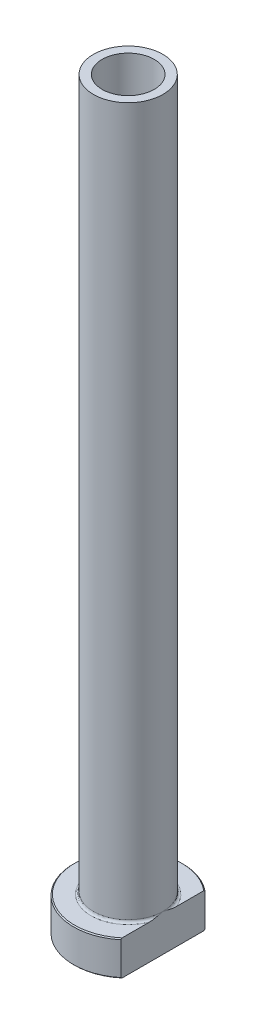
ISO-10303-21;
HEADER;
FILE_DESCRIPTION(('STEP AP214'),'2;1');
FILE_NAME('part.step','',(''),(''),'','','');
FILE_SCHEMA(('AUTOMOTIVE_DESIGN { 1 0 10303 214 1 1 1 1 }'));
ENDSEC;
DATA;
#1=APPLICATION_CONTEXT('core data for automotive mechanical design processes');
#2=APPLICATION_PROTOCOL_DEFINITION('international standard','automotive_design',2000,#1);
#3=PRODUCT_CONTEXT('',#1,'mechanical');
#4=PRODUCT('Part','Part','',(#3));
#5=PRODUCT_RELATED_PRODUCT_CATEGORY('part','',(#4));
#6=PRODUCT_DEFINITION_FORMATION('','',#4);
#7=PRODUCT_DEFINITION_CONTEXT('part definition',#1,'design');
#8=PRODUCT_DEFINITION('design','',#6,#7);
#9=PRODUCT_DEFINITION_SHAPE('','',#8);
#10=(LENGTH_UNIT() NAMED_UNIT(*) SI_UNIT(.MILLI.,.METRE.));
#11=(NAMED_UNIT(*) PLANE_ANGLE_UNIT() SI_UNIT($,.RADIAN.));
#12=(NAMED_UNIT(*) SI_UNIT($,.STERADIAN.) SOLID_ANGLE_UNIT());
#13=UNCERTAINTY_MEASURE_WITH_UNIT(LENGTH_MEASURE(1.E-05),#10,'distance_accuracy_value','');
#14=(GEOMETRIC_REPRESENTATION_CONTEXT(3) GLOBAL_UNCERTAINTY_ASSIGNED_CONTEXT((#13)) GLOBAL_UNIT_ASSIGNED_CONTEXT((#10,
#11,#12)) REPRESENTATION_CONTEXT('',''));
#15=CARTESIAN_POINT('',(0.,0.,0.));
#16=DIRECTION('',(0.,0.,1.));
#17=DIRECTION('',(1.,0.,0.));
#18=AXIS2_PLACEMENT_3D('',#15,#16,#17);
#19=CARTESIAN_POINT('',(0.,92.1876809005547,0.));
#20=DIRECTION('',(0.,1.,0.));
#21=DIRECTION('',(0.,0.,1.));
#22=AXIS2_PLACEMENT_3D('',#19,#20,#21);
#23=CYLINDRICAL_SURFACE('',#22,5.25);
#24=CARTESIAN_POINT('',(0.,150.,0.));
#25=DIRECTION('',(0.,1.,0.));
#26=DIRECTION('',(0.,0.,1.));
#27=AXIS2_PLACEMENT_3D('',#24,#25,#26);
#28=CIRCLE('',#27,5.25);
#29=CARTESIAN_POINT('',(0.,150.,5.25));
#30=VERTEX_POINT('',#29);
#31=EDGE_CURVE('E167',#30,#30,#28,.T.);
#32=ORIENTED_EDGE('',*,*,#31,.T.);
#33=EDGE_LOOP('',(#32));
#34=FACE_BOUND('',#33,.T.);
#35=CARTESIAN_POINT('',(0.,95.,0.));
#36=DIRECTION('',(0.,1.,0.));
#37=DIRECTION('',(0.,0.,1.));
#38=AXIS2_PLACEMENT_3D('',#35,#36,#37);
#39=CIRCLE('',#38,5.25);
#40=CARTESIAN_POINT('',(0.,95.,5.25));
#41=VERTEX_POINT('',#40);
#42=EDGE_CURVE('E170',#41,#41,#39,.T.);
#43=ORIENTED_EDGE('',*,*,#42,.F.);
#44=EDGE_LOOP('',(#43));
#45=FACE_BOUND('',#44,.T.);
#46=ADVANCED_FACE('F32',(#34,#45),#23,.F.);
#47=CARTESIAN_POINT('',(-5.25,150.,0.));
#48=DIRECTION('',(0.,1.,0.));
#49=DIRECTION('',(0.,0.,1.));
#50=AXIS2_PLACEMENT_3D('',#47,#48,#49);
#51=PLANE('',#50);
#52=CARTESIAN_POINT('',(0.,150.,0.));
#53=DIRECTION('',(0.,1.,0.));
#54=DIRECTION('',(0.,0.,1.));
#55=AXIS2_PLACEMENT_3D('',#52,#53,#54);
#56=CIRCLE('',#55,7.00000000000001);
#57=CARTESIAN_POINT('',(0.,150.,7.00000000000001));
#58=VERTEX_POINT('',#57);
#59=EDGE_CURVE('E174',#58,#58,#56,.T.);
#60=ORIENTED_EDGE('',*,*,#59,.T.);
#61=EDGE_LOOP('',(#60));
#62=FACE_BOUND('',#61,.T.);
#63=ORIENTED_EDGE('',*,*,#31,.F.);
#64=EDGE_LOOP('',(#63));
#65=FACE_BOUND('',#64,.T.);
#66=ADVANCED_FACE('F157',(#62,#65),#51,.T.);
#67=CARTESIAN_POINT('',(0.,92.1876809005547,0.));
#68=DIRECTION('',(0.,1.,0.));
#69=DIRECTION('',(0.,0.,1.));
#70=AXIS2_PLACEMENT_3D('',#67,#68,#69);
#71=CYLINDRICAL_SURFACE('',#70,7.);
#72=CARTESIAN_POINT('',(0.,7.50000000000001,0.));
#73=DIRECTION('',(0.,1.,0.));
#74=DIRECTION('',(0.,0.,1.));
#75=AXIS2_PLACEMENT_3D('',#72,#73,#74);
#76=CIRCLE('',#75,7.);
#77=CARTESIAN_POINT('',(7.,7.50000000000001,0.));
#78=VERTEX_POINT('',#77);
#79=EDGE_CURVE('E180',#78,#78,#76,.T.);
#80=ORIENTED_EDGE('',*,*,#79,.T.);
#81=EDGE_LOOP('',(#80));
#82=FACE_BOUND('',#81,.T.);
#83=ORIENTED_EDGE('',*,*,#59,.F.);
#84=EDGE_LOOP('',(#83));
#85=FACE_BOUND('',#84,.T.);
#86=ADVANCED_FACE('F162',(#82,#85),#71,.T.);
#87=CARTESIAN_POINT('',(-6.99999999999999,7.,0.));
#88=DIRECTION('',(0.,1.,0.));
#89=DIRECTION('',(0.,0.,1.));
#90=AXIS2_PLACEMENT_3D('',#87,#88,#89);
#91=PLANE('',#90);
#92=DIRECTION('',(0.,0.,1.));
#93=VECTOR('',#92,1.);
#94=CARTESIAN_POINT('',(6.99999999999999,7.,0.));
#95=LINE('',#94,#93);
#96=CARTESIAN_POINT('',(7.,7.,-8.22435407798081));
#97=VERTEX_POINT('',#96);
#98=CARTESIAN_POINT('',(6.99999999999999,7.,-2.69258240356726));
#99=VERTEX_POINT('',#98);
#100=EDGE_CURVE('E54',#97,#99,#95,.T.);
#101=ORIENTED_EDGE('',*,*,#100,.F.);
#102=CARTESIAN_POINT('',(0.,7.,0.));
#103=DIRECTION('',(0.,1.,0.));
#104=DIRECTION('',(0.,0.,1.));
#105=AXIS2_PLACEMENT_3D('',#102,#103,#104);
#106=CIRCLE('',#105,10.8);
#107=CARTESIAN_POINT('',(6.99999999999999,7.,8.22435407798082));
#108=VERTEX_POINT('',#107);
#109=EDGE_CURVE('E186',#97,#108,#106,.T.);
#110=ORIENTED_EDGE('',*,*,#109,.T.);
#111=CARTESIAN_POINT('',(6.99999999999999,7.,2.69258240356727));
#112=VERTEX_POINT('',#111);
#113=EDGE_CURVE('E134',#112,#108,#95,.T.);
#114=ORIENTED_EDGE('',*,*,#113,.F.);
#115=CARTESIAN_POINT('',(0.,7.,0.));
#116=DIRECTION('',(0.,1.,0.));
#117=DIRECTION('',(0.,0.,1.));
#118=AXIS2_PLACEMENT_3D('',#115,#116,#117);
#119=CIRCLE('',#118,7.5);
#120=EDGE_CURVE('E183',#112,#99,#119,.F.);
#121=ORIENTED_EDGE('',*,*,#120,.T.);
#122=EDGE_LOOP('',(#101,#110,#114,#121));
#123=FACE_BOUND('',#122,.T.);
#124=ADVANCED_FACE('F197',(#123),#91,.T.);
#125=CARTESIAN_POINT('',(0.,92.1876809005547,0.));
#126=DIRECTION('',(0.,1.,0.));
#127=DIRECTION('',(0.,0.,1.));
#128=AXIS2_PLACEMENT_3D('',#125,#126,#127);
#129=CYLINDRICAL_SURFACE('',#128,11.);
#130=DIRECTION('',(0.,-1.,0.));
#131=VECTOR('',#130,1.);
#132=CARTESIAN_POINT('',(6.99999999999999,150.,8.48528137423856));
#133=LINE('',#132,#131);
#134=CARTESIAN_POINT('',(6.99999999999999,6.79999999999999,8.48528137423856));
#135=VERTEX_POINT('',#134);
#136=CARTESIAN_POINT('',(6.99999999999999,0.200000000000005,8.48528137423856));
#137=VERTEX_POINT('',#136);
#138=EDGE_CURVE('E82',#135,#137,#133,.T.);
#139=ORIENTED_EDGE('',*,*,#138,.F.);
#140=CARTESIAN_POINT('',(0.,6.79999999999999,0.));
#141=DIRECTION('',(0.,1.,0.));
#142=DIRECTION('',(0.,0.,1.));
#143=AXIS2_PLACEMENT_3D('',#140,#141,#142);
#144=CIRCLE('',#143,11.);
#145=CARTESIAN_POINT('',(7.,6.79999999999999,-8.48528137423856));
#146=VERTEX_POINT('',#145);
#147=EDGE_CURVE('E95',#135,#146,#144,.F.);
#148=ORIENTED_EDGE('',*,*,#147,.T.);
#149=DIRECTION('',(0.,-1.,0.));
#150=VECTOR('',#149,1.);
#151=CARTESIAN_POINT('',(7.,150.,-8.48528137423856));
#152=LINE('',#151,#150);
#153=CARTESIAN_POINT('',(7.,0.200000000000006,-8.48528137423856));
#154=VERTEX_POINT('',#153);
#155=EDGE_CURVE('E192',#146,#154,#152,.T.);
#156=ORIENTED_EDGE('',*,*,#155,.T.);
#157=CARTESIAN_POINT('',(0.,0.200000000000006,0.));
#158=DIRECTION('',(0.,-1.,0.));
#159=DIRECTION('',(0.,0.,-1.));
#160=AXIS2_PLACEMENT_3D('',#157,#158,#159);
#161=CIRCLE('',#160,11.);
#162=EDGE_CURVE('E98',#154,#137,#161,.F.);
#163=ORIENTED_EDGE('',*,*,#162,.T.);
#164=EDGE_LOOP('',(#139,#148,#156,#163));
#165=FACE_BOUND('',#164,.T.);
#166=ADVANCED_FACE('F190',(#165),#129,.T.);
#167=CARTESIAN_POINT('',(-11.,0.,0.));
#168=DIRECTION('',(0.,-1.,0.));
#169=DIRECTION('',(0.,0.,-1.));
#170=AXIS2_PLACEMENT_3D('',#167,#168,#169);
#171=PLANE('',#170);
#172=CARTESIAN_POINT('',(0.,0.,0.));
#173=DIRECTION('',(0.,-1.,0.));
#174=DIRECTION('',(0.,0.,-1.));
#175=AXIS2_PLACEMENT_3D('',#172,#173,#174);
#176=CIRCLE('',#175,5.99999999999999);
#177=CARTESIAN_POINT('',(0.,0.,-5.99999999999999));
#178=VERTEX_POINT('',#177);
#179=EDGE_CURVE('E40',#178,#178,#176,.F.);
#180=ORIENTED_EDGE('',*,*,#179,.T.);
#181=EDGE_LOOP('',(#180));
#182=FACE_BOUND('',#181,.T.);
#183=DIRECTION('',(0.,0.,-1.));
#184=VECTOR('',#183,1.);
#185=CARTESIAN_POINT('',(6.99999999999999,0.,8.48528137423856));
#186=LINE('',#185,#184);
#187=CARTESIAN_POINT('',(6.99999999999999,0.,8.22435407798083));
#188=VERTEX_POINT('',#187);
#189=CARTESIAN_POINT('',(7.,0.,-8.22435407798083));
#190=VERTEX_POINT('',#189);
#191=EDGE_CURVE('E47',#188,#190,#186,.T.);
#192=ORIENTED_EDGE('',*,*,#191,.F.);
#193=CARTESIAN_POINT('',(0.,0.,0.));
#194=DIRECTION('',(0.,-1.,0.));
#195=DIRECTION('',(0.,0.,-1.));
#196=AXIS2_PLACEMENT_3D('',#193,#194,#195);
#197=CIRCLE('',#196,10.8);
#198=EDGE_CURVE('E92',#188,#190,#197,.T.);
#199=ORIENTED_EDGE('',*,*,#198,.T.);
#200=EDGE_LOOP('',(#192,#199));
#201=FACE_BOUND('',#200,.T.);
#202=ADVANCED_FACE('F91',(#182,#201),#171,.T.);
#203=CARTESIAN_POINT('',(0.,92.1876809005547,0.));
#204=DIRECTION('',(0.,1.,0.));
#205=DIRECTION('',(0.,0.,1.));
#206=AXIS2_PLACEMENT_3D('',#203,#204,#205);
#207=CYLINDRICAL_SURFACE('',#206,5.5);
#208=CARTESIAN_POINT('',(0.,0.499999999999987,0.));
#209=DIRECTION('',(0.,-1.,0.));
#210=DIRECTION('',(0.,0.,-1.));
#211=AXIS2_PLACEMENT_3D('',#208,#209,#210);
#212=CIRCLE('',#211,5.5);
#213=CARTESIAN_POINT('',(0.,0.499999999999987,-5.5));
#214=VERTEX_POINT('',#213);
#215=EDGE_CURVE('E11',#214,#214,#212,.T.);
#216=ORIENTED_EDGE('',*,*,#215,.T.);
#217=EDGE_LOOP('',(#216));
#218=FACE_BOUND('',#217,.T.);
#219=CARTESIAN_POINT('',(0.,83.,0.));
#220=DIRECTION('',(0.,1.,0.));
#221=DIRECTION('',(0.,0.,1.));
#222=AXIS2_PLACEMENT_3D('',#219,#220,#221);
#223=CIRCLE('',#222,5.5);
#224=CARTESIAN_POINT('',(0.,83.,5.5));
#225=VERTEX_POINT('',#224);
#226=EDGE_CURVE('E172',#225,#225,#223,.T.);
#227=ORIENTED_EDGE('',*,*,#226,.T.);
#228=EDGE_LOOP('',(#227));
#229=FACE_BOUND('',#228,.T.);
#230=ADVANCED_FACE('F215',(#218,#229),#207,.F.);
#231=CARTESIAN_POINT('',(0.,83.,0.));
#232=DIRECTION('',(0.,-1.,0.));
#233=DIRECTION('',(0.,0.,-1.));
#234=AXIS2_PLACEMENT_3D('',#231,#232,#233);
#235=CONICAL_SURFACE('',#234,5.5,0.0208303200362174);
#236=ORIENTED_EDGE('',*,*,#42,.T.);
#237=EDGE_LOOP('',(#236));
#238=FACE_BOUND('',#237,.T.);
#239=ORIENTED_EDGE('',*,*,#226,.F.);
#240=EDGE_LOOP('',(#239));
#241=FACE_BOUND('',#240,.T.);
#242=ADVANCED_FACE('F111',(#238,#241),#235,.F.);
#243=CARTESIAN_POINT('',(0.,7.50000000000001,0.));
#244=DIRECTION('',(0.,1.,0.));
#245=DIRECTION('',(0.,0.,1.));
#246=AXIS2_PLACEMENT_3D('',#243,#244,#245);
#247=TOROIDAL_SURFACE('',#246,7.5,0.5);
#248=ORIENTED_EDGE('',*,*,#120,.F.);
#249=CARTESIAN_POINT('',(7.,7.50000000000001,0.));
#250=CARTESIAN_POINT('',(7.,7.50000080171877,-1.25568479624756E-10));
#251=CARTESIAN_POINT('',(7.,7.50000160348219,2.9022028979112E-07));
#252=CARTESIAN_POINT('',(7.,7.50000310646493,1.10846445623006E-06));
#253=CARTESIAN_POINT('',(7.,7.50000379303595,1.65470117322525E-06));
#254=CARTESIAN_POINT('',(7.,7.50000521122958,2.96102760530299E-06));
#255=CARTESIAN_POINT('',(7.,7.50000592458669,3.74204187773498E-06));
#256=CARTESIAN_POINT('',(7.,7.50000721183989,5.36891885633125E-06));
#257=CARTESIAN_POINT('',(7.,7.50000778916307,6.21226355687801E-06));
#258=CARTESIAN_POINT('',(7.,7.50000990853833,9.44889721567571E-06));
#259=CARTESIAN_POINT('',(7.,7.50001133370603,1.19224915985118E-05));
#260=CARTESIAN_POINT('',(7.,7.50001370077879,1.68453050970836E-05));
#261=CARTESIAN_POINT('',(7.,7.50001467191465,1.92810864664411E-05));
#262=CARTESIAN_POINT('',(7.,7.5000187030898,2.95057529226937E-05));
#263=CARTESIAN_POINT('',(7.,7.50002167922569,3.73333827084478E-05));
#264=CARTESIAN_POINT('',(7.,7.5000261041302,5.21820419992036E-05));
#265=CARTESIAN_POINT('',(7.,7.50002771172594,5.91556020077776E-05));
#266=CARTESIAN_POINT('',(7.,7.50003935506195,0.000110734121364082));
#267=CARTESIAN_POINT('',(7.,7.50004810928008,0.000155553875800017));
#268=CARTESIAN_POINT('',(6.99999999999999,7.50008643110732,0.00033254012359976));
#269=CARTESIAN_POINT('',(6.99999999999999,7.50012307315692,0.000463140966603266));
#270=CARTESIAN_POINT('',(7.,7.50026565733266,0.000980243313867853));
#271=CARTESIAN_POINT('',(7.,7.50036696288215,0.00136762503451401));
#272=CARTESIAN_POINT('',(6.99999999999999,7.50077257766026,0.00290683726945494));
#273=CARTESIAN_POINT('',(6.99999999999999,7.5010826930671,0.00405753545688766));
#274=CARTESIAN_POINT('',(7.,7.50237341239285,0.00885983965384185));
#275=CARTESIAN_POINT('',(7.,7.50334676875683,0.0125128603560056));
#276=CARTESIAN_POINT('',(6.99999999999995,7.51627189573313,0.0610038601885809));
#277=CARTESIAN_POINT('',(6.99999999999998,7.52827280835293,0.105832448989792));
#278=CARTESIAN_POINT('',(7.00000000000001,7.551709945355,0.193693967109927));
#279=CARTESIAN_POINT('',(7.,7.56314936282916,0.236726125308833));
#280=CARTESIAN_POINT('',(6.99999999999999,7.58740418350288,0.328321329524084));
#281=CARTESIAN_POINT('',(6.99999999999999,7.60020832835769,0.376887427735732));
#282=CARTESIAN_POINT('',(7.,7.62578161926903,0.474605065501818));
#283=CARTESIAN_POINT('',(7.,7.63854879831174,0.523757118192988));
#284=CARTESIAN_POINT('',(6.99999999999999,7.66904753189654,0.642366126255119));
#285=CARTESIAN_POINT('',(7.,7.68665961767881,0.711854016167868));
#286=CARTESIAN_POINT('',(7.,7.72074501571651,0.849103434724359));
#287=CARTESIAN_POINT('',(7.,7.73723627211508,0.916860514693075));
#288=CARTESIAN_POINT('',(7.,7.79038156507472,1.1410421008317));
#289=CARTESIAN_POINT('',(7.,7.82528973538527,1.29788860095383));
#290=CARTESIAN_POINT('',(7.,7.88862298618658,1.61471917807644));
#291=CARTESIAN_POINT('',(7.,7.91697354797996,1.77471883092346));
#292=CARTESIAN_POINT('',(7.,7.95258292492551,2.02253505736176));
#293=CARTESIAN_POINT('',(7.,7.96355251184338,2.10981398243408));
#294=CARTESIAN_POINT('',(7.,7.98165287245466,2.28476193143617));
#295=CARTESIAN_POINT('',(7.,7.98878459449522,2.37243085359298));
#296=CARTESIAN_POINT('',(7.,7.99822919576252,2.54760327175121));
#297=CARTESIAN_POINT('',(7.,8.00056589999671,2.63510541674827));
#298=CARTESIAN_POINT('',(7.,7.99919996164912,2.81004074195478));
#299=CARTESIAN_POINT('',(7.,7.99550272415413,2.89747391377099));
#300=CARTESIAN_POINT('',(7.,7.98391011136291,3.02882076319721));
#301=CARTESIAN_POINT('',(7.,7.9789723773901,3.0729968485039));
#302=CARTESIAN_POINT('',(7.,7.96665453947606,3.16105400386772));
#303=CARTESIAN_POINT('',(7.,7.9592724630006,3.20493480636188));
#304=CARTESIAN_POINT('',(7.,7.94168688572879,3.29163191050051));
#305=CARTESIAN_POINT('',(7.,7.93151559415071,3.3344546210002));
#306=CARTESIAN_POINT('',(7.,7.90768392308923,3.41909658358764));
#307=CARTESIAN_POINT('',(7.,7.89402748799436,3.46091691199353));
#308=CARTESIAN_POINT('',(7.,7.86214701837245,3.54331777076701));
#309=CARTESIAN_POINT('',(7.,7.84387618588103,3.58388050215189));
#310=CARTESIAN_POINT('',(7.,7.80145892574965,3.66184445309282));
#311=CARTESIAN_POINT('',(7.,7.77733569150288,3.69925738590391));
#312=CARTESIAN_POINT('',(7.,7.73714014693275,3.74836513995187));
#313=CARTESIAN_POINT('',(7.,7.72423208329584,3.76263695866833));
#314=CARTESIAN_POINT('',(7.,7.69673765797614,3.78951670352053));
#315=CARTESIAN_POINT('',(7.,7.68215013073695,3.80212346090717));
#316=CARTESIAN_POINT('',(7.,7.65099843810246,3.82514624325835));
#317=CARTESIAN_POINT('',(7.,7.63441049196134,3.83553078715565));
#318=CARTESIAN_POINT('',(7.,7.59955798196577,3.8529401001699));
#319=CARTESIAN_POINT('',(7.,7.58129885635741,3.85997533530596));
#320=CARTESIAN_POINT('',(7.,7.54906837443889,3.86837810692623));
#321=CARTESIAN_POINT('',(7.,7.53536870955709,3.87079233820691));
#322=CARTESIAN_POINT('',(7.,7.50775756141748,3.87325240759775));
#323=CARTESIAN_POINT('',(7.,7.4938461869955,3.87329942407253));
#324=CARTESIAN_POINT('',(7.,7.46623771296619,3.87102093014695));
#325=CARTESIAN_POINT('',(7.,7.45254041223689,3.8686978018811));
#326=CARTESIAN_POINT('',(7.,7.42569741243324,3.86188775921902));
#327=CARTESIAN_POINT('',(7.,7.41255212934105,3.85739924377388));
#328=CARTESIAN_POINT('',(7.,7.3825931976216,3.84468786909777));
#329=CARTESIAN_POINT('',(7.,7.36610215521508,3.83570823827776));
#330=CARTESIAN_POINT('',(7.,7.33476729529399,3.81523202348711));
#331=CARTESIAN_POINT('',(7.,7.31992737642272,3.80372966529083));
#332=CARTESIAN_POINT('',(7.,7.28371925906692,3.77170797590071));
#333=CARTESIAN_POINT('',(7.,7.26356272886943,3.74983059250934));
#334=CARTESIAN_POINT('',(7.,7.22671696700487,3.70338283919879));
#335=CARTESIAN_POINT('',(7.,7.2100336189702,3.67880800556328));
#336=CARTESIAN_POINT('',(7.,7.18026553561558,3.62921731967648));
#337=CARTESIAN_POINT('',(7.,7.16704475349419,3.60428175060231));
#338=CARTESIAN_POINT('',(7.,7.14275069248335,3.55337478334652));
#339=CARTESIAN_POINT('',(7.,7.1316794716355,3.52740242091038));
#340=CARTESIAN_POINT('',(7.,7.10104499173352,3.44809573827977));
#341=CARTESIAN_POINT('',(7.,7.08424174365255,3.39369851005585));
#342=CARTESIAN_POINT('',(7.,7.05431378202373,3.27667221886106));
#343=CARTESIAN_POINT('',(7.,7.04191718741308,3.21386807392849));
#344=CARTESIAN_POINT('',(7.,7.02234605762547,3.08735184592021));
#345=CARTESIAN_POINT('',(7.,7.01518234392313,3.0236381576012));
#346=CARTESIAN_POINT('',(7.,7.00517826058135,2.8977900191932));
#347=CARTESIAN_POINT('',(7.,7.00221627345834,2.8356646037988));
#348=CARTESIAN_POINT('',(7.,6.99952325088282,2.71160626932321));
#349=CARTESIAN_POINT('',(7.,6.99977918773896,2.64967358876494));
#350=CARTESIAN_POINT('',(7.,7.00377761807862,2.49407814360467));
#351=CARTESIAN_POINT('',(7.,7.00924384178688,2.40046113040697));
#352=CARTESIAN_POINT('',(7.,7.02494106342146,2.21367396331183));
#353=CARTESIAN_POINT('',(7.,7.0351710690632,2.12050372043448));
#354=CARTESIAN_POINT('',(7.,7.05969765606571,1.93249035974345));
#355=CARTESIAN_POINT('',(7.,7.07408383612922,1.83765914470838));
#356=CARTESIAN_POINT('',(7.,7.1060330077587,1.6482934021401));
#357=CARTESIAN_POINT('',(7.,7.12360402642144,1.55376025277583));
#358=CARTESIAN_POINT('',(7.,7.16806468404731,1.33086107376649));
#359=CARTESIAN_POINT('',(7.,7.19601783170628,1.20270896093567));
#360=CARTESIAN_POINT('',(7.,7.25475947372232,0.948586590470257));
#361=CARTESIAN_POINT('',(7.,7.28551257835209,0.822607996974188));
#362=CARTESIAN_POINT('',(7.,7.33123897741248,0.64133402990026));
#363=CARTESIAN_POINT('',(7.,7.34543722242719,0.585840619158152));
#364=CARTESIAN_POINT('',(6.99999999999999,7.37418243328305,0.474686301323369));
#365=CARTESIAN_POINT('',(6.99999999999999,7.38873064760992,0.419025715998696));
#366=CARTESIAN_POINT('',(7.,7.41873357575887,0.305011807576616));
#367=CARTESIAN_POINT('',(7.,7.43419762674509,0.246660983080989));
#368=CARTESIAN_POINT('',(6.99999999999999,7.46502361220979,0.130933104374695));
#369=CARTESIAN_POINT('',(6.99999999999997,7.48038319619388,0.073555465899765));
#370=CARTESIAN_POINT('',(7.,7.49665455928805,0.0125077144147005));
#371=CARTESIAN_POINT('',(7.,7.49762931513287,0.00884956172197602));
#372=CARTESIAN_POINT('',(6.99999999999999,7.49892036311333,0.00404608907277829));
#373=CARTESIAN_POINT('',(6.99999999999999,7.49922940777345,0.00289935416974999));
#374=CARTESIAN_POINT('',(7.,7.49963371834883,0.00136508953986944));
#375=CARTESIAN_POINT('',(7.,7.49973476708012,0.000978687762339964));
#376=CARTESIAN_POINT('',(6.99999999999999,7.49987704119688,0.00046273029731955));
#377=CARTESIAN_POINT('',(6.99999999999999,7.4999136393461,0.000332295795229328));
#378=CARTESIAN_POINT('',(7.,7.49995192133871,0.000155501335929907));
#379=CARTESIAN_POINT('',(7.,7.49996067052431,0.000110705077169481));
#380=CARTESIAN_POINT('',(7.,7.49997230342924,5.91504871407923E-05));
#381=CARTESIAN_POINT('',(7.,7.49997390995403,5.21782476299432E-05));
#382=CARTESIAN_POINT('',(7.,7.49997833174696,3.73322821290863E-05));
#383=CARTESIAN_POINT('',(7.,7.49998130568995,2.95059555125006E-05));
#384=CARTESIAN_POINT('',(7.,7.49998533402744,1.92826357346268E-05));
#385=CARTESIAN_POINT('',(7.,7.49998630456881,1.68469531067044E-05));
#386=CARTESIAN_POINT('',(7.,7.49998867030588,1.19242379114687E-05));
#387=CARTESIAN_POINT('',(7.,7.49999009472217,9.45063101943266E-06));
#388=CARTESIAN_POINT('',(7.,7.49999221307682,6.21386478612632E-06));
#389=CARTESIAN_POINT('',(7.,7.4999927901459,5.37045339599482E-06));
#390=CARTESIAN_POINT('',(7.,7.49999407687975,3.74339717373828E-06));
#391=CARTESIAN_POINT('',(7.,7.49999478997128,2.96226879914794E-06));
#392=CARTESIAN_POINT('',(7.,7.49999620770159,1.65567359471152E-06));
#393=CARTESIAN_POINT('',(7.,7.49999689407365,1.10929204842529E-06));
#394=CARTESIAN_POINT('',(7.,7.49999839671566,2.90683225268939E-07));
#395=CARTESIAN_POINT('',(7.,7.49999919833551,1.25561410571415E-10));
#396=CARTESIAN_POINT('',(7.,7.50000000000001,0.));
#397=B_SPLINE_CURVE_WITH_KNOTS('',3,(#249,#250,#251,#252,#253,#254,#255,#256,#257,#258,#259,
#260,#261,#262,#263,#264,#265,#266,#267,#268,#269,#270,#271,#272,#273,#274,#275,#276,#277,#278,
#279,#280,#281,#282,#283,#284,#285,#286,#287,#288,#289,#290,#291,#292,#293,#294,#295,#296,#297,
#298,#299,#300,#301,#302,#303,#304,#305,#306,#307,#308,#309,#310,#311,#312,#313,#314,#315,#316,
#317,#318,#319,#320,#321,#322,#323,#324,#325,#326,#327,#328,#329,#330,#331,#332,#333,#334,#335,
#336,#337,#338,#339,#340,#341,#342,#343,#344,#345,#346,#347,#348,#349,#350,#351,#352,#353,#354,
#355,#356,#357,#358,#359,#360,#361,#362,#363,#364,#365,#366,#367,#368,#369,#370,#371,#372,#373,
#374,#375,#376,#377,#378,#379,#380,#381,#382,#383,#384,#385,#386,#387,#388,#389,#390,#391,#392,
#393,#394,#395,#396),.UNSPECIFIED.,.T.,.F.,(4,2,2,2,2,2,2,2,2,2,2,2,2,2,2,2,2,2,2,2,2,2,2,2,2,2,
2,2,2,2,2,2,2,2,2,2,2,2,2,2,2,2,2,2,2,2,2,2,2,2,2,2,2,2,2,2,2,2,2,2,2,2,2,2,2,2,2,2,2,2,2,2,2,
4),(0.,2.42201381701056E-06,5.0530479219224E-06,8.20814016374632E-06,1.12722920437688E-05,
1.98044004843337E-05,2.76642048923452E-05,5.27403832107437E-05,7.41830767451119E-05,
0.000211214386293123,0.000617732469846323,0.00181938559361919,0.00539412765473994,
0.016736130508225,0.155952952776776,0.2895341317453,0.440210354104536,0.592559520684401,
0.807611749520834,1.0168149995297,1.49878389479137,1.98598665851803,2.24981935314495,
2.5135868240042,2.77604050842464,3.03825922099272,3.17156039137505,3.3049693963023,
3.43689837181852,3.5686786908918,3.70185328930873,3.83450849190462,3.89212877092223,
3.94978928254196,4.00821928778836,4.06646549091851,4.10801107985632,4.14953598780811,
4.19101920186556,4.23253313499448,4.28854866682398,4.34469377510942,4.4334341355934,
4.52232362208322,4.60686785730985,4.69149264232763,4.86185145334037,5.05362927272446,
5.24580256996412,5.43229132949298,5.61802533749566,5.89918385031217,6.18028382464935,
6.46796485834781,6.75638131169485,7.14981284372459,7.53882346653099,7.71066604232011,
7.88325629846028,8.0643532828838,8.24254095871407,8.25389891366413,8.25746134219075,
8.25865995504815,8.25906595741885,8.25920291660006,8.25922435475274,8.25924942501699,
8.25925728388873,8.25926581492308,8.25926887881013,8.25927203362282,8.25927466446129,
8.25927708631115),.UNSPECIFIED.);
#398=EDGE_CURVE('E126',#112,#78,#397,.T.);
#399=ORIENTED_EDGE('',*,*,#398,.T.);
#400=ORIENTED_EDGE('',*,*,#79,.F.);
#401=CARTESIAN_POINT('',(7.,7.50000000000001,0.));
#402=CARTESIAN_POINT('',(7.,7.49999919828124,1.25569885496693E-10));
#403=CARTESIAN_POINT('',(7.,7.49999839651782,-2.90220288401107E-07));
#404=CARTESIAN_POINT('',(7.,7.49999689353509,-1.10846445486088E-06));
#405=CARTESIAN_POINT('',(7.,7.49999620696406,-1.65470117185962E-06));
#406=CARTESIAN_POINT('',(7.,7.49999478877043,-2.96102760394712E-06));
#407=CARTESIAN_POINT('',(7.,7.49999407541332,-3.7420418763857E-06));
#408=CARTESIAN_POINT('',(7.,7.49999278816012,-5.36891885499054E-06));
#409=CARTESIAN_POINT('',(7.,7.49999221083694,-6.2122635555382E-06));
#410=CARTESIAN_POINT('',(7.,7.49999009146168,-9.44889721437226E-06));
#411=CARTESIAN_POINT('',(7.,7.49998866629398,-1.19224915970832E-05));
#412=CARTESIAN_POINT('',(7.,7.49998629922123,-1.68453050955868E-05));
#413=CARTESIAN_POINT('',(7.,7.49998532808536,-1.92810864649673E-05));
#414=CARTESIAN_POINT('',(7.,7.49998129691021,-2.950575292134E-05));
#415=CARTESIAN_POINT('',(7.,7.49997832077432,-3.73333827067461E-05));
#416=CARTESIAN_POINT('',(7.,7.49997389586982,-5.21820419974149E-05));
#417=CARTESIAN_POINT('',(7.,7.49997228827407,-5.91556020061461E-05));
#418=CARTESIAN_POINT('',(7.,7.49996064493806,-0.000110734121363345));
#419=CARTESIAN_POINT('',(7.,7.49995189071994,-0.000155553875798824));
#420=CARTESIAN_POINT('',(6.99999999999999,7.49991356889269,-0.000332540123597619));
#421=CARTESIAN_POINT('',(6.99999999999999,7.49987692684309,-0.00046314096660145));
#422=CARTESIAN_POINT('',(7.,7.49973434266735,-0.000980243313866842));
#423=CARTESIAN_POINT('',(7.,7.49963303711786,-0.00136762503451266));
#424=CARTESIAN_POINT('',(6.99999999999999,7.49922742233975,-0.0029068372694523));
#425=CARTESIAN_POINT('',(6.99999999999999,7.49891730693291,-0.00405753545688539));
#426=CARTESIAN_POINT('',(7.,7.49762658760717,-0.00885983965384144));
#427=CARTESIAN_POINT('',(7.,7.49665323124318,-0.0125128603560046));
#428=CARTESIAN_POINT('',(6.99999999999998,7.48372810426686,-0.0610038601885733));
#429=CARTESIAN_POINT('',(6.99999999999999,7.47172719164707,-0.105832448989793));
#430=CARTESIAN_POINT('',(7.,7.44829005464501,-0.193693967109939));
#431=CARTESIAN_POINT('',(7.,7.43685063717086,-0.236726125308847));
#432=CARTESIAN_POINT('',(6.99999999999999,7.41259581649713,-0.328321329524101));
#433=CARTESIAN_POINT('',(7.,7.39979167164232,-0.376887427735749));
#434=CARTESIAN_POINT('',(7.,7.37421838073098,-0.474605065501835));
#435=CARTESIAN_POINT('',(7.,7.36145120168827,-0.523757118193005));
#436=CARTESIAN_POINT('',(7.,7.33095246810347,-0.642366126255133));
#437=CARTESIAN_POINT('',(7.,7.3133403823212,-0.711854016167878));
#438=CARTESIAN_POINT('',(7.,7.2792549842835,-0.849103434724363));
#439=CARTESIAN_POINT('',(7.,7.26276372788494,-0.916860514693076));
#440=CARTESIAN_POINT('',(7.,7.20961843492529,-1.1410421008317));
#441=CARTESIAN_POINT('',(7.,7.17471026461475,-1.29788860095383));
#442=CARTESIAN_POINT('',(7.,7.11137701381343,-1.61471917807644));
#443=CARTESIAN_POINT('',(7.,7.08302645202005,-1.77471883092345));
#444=CARTESIAN_POINT('',(7.,7.0474170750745,-2.02253505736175));
#445=CARTESIAN_POINT('',(7.,7.03644748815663,-2.10981398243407));
#446=CARTESIAN_POINT('',(7.,7.01834712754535,-2.28476193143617));
#447=CARTESIAN_POINT('',(7.,7.01121540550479,-2.37243085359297));
#448=CARTESIAN_POINT('',(7.,7.00177080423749,-2.5476032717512));
#449=CARTESIAN_POINT('',(7.,6.9994341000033,-2.63510541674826));
#450=CARTESIAN_POINT('',(7.,7.00080003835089,-2.81004074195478));
#451=CARTESIAN_POINT('',(7.,7.00449727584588,-2.89747391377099));
#452=CARTESIAN_POINT('',(7.,7.01608988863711,-3.02882076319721));
#453=CARTESIAN_POINT('',(7.,7.02102762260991,-3.0729968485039));
#454=CARTESIAN_POINT('',(7.,7.03334546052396,-3.16105400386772));
#455=CARTESIAN_POINT('',(7.,7.04072753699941,-3.20493480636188));
#456=CARTESIAN_POINT('',(7.,7.05831311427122,-3.29163191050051));
#457=CARTESIAN_POINT('',(7.,7.06848440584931,-3.3344546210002));
#458=CARTESIAN_POINT('',(7.,7.09231607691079,-3.41909658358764));
#459=CARTESIAN_POINT('',(7.,7.10597251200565,-3.46091691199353));
#460=CARTESIAN_POINT('',(7.,7.13785298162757,-3.54331777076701));
#461=CARTESIAN_POINT('',(7.,7.15612381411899,-3.58388050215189));
#462=CARTESIAN_POINT('',(7.,7.19854107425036,-3.66184445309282));
#463=CARTESIAN_POINT('',(7.,7.22266430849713,-3.69925738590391));
#464=CARTESIAN_POINT('',(7.,7.26285985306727,-3.74836513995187));
#465=CARTESIAN_POINT('',(7.,7.27576791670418,-3.76263695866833));
#466=CARTESIAN_POINT('',(7.,7.30326234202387,-3.78951670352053));
#467=CARTESIAN_POINT('',(7.,7.31784986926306,-3.80212346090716));
#468=CARTESIAN_POINT('',(7.,7.34900156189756,-3.82514624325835));
#469=CARTESIAN_POINT('',(7.,7.36558950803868,-3.83553078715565));
#470=CARTESIAN_POINT('',(7.,7.40044201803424,-3.8529401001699));
#471=CARTESIAN_POINT('',(7.,7.4187011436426,-3.85997533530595));
#472=CARTESIAN_POINT('',(7.,7.45093162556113,-3.86837810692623));
#473=CARTESIAN_POINT('',(7.,7.46463129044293,-3.87079233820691));
#474=CARTESIAN_POINT('',(7.,7.49224243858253,-3.87325240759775));
#475=CARTESIAN_POINT('',(7.,7.50615381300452,-3.87329942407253));
#476=CARTESIAN_POINT('',(7.,7.53376228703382,-3.87102093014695));
#477=CARTESIAN_POINT('',(7.,7.54745958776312,-3.8686978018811));
#478=CARTESIAN_POINT('',(7.,7.57430258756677,-3.86188775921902));
#479=CARTESIAN_POINT('',(7.,7.58744787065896,-3.85739924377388));
#480=CARTESIAN_POINT('',(7.,7.61740680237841,-3.84468786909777));
#481=CARTESIAN_POINT('',(7.,7.63389784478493,-3.83570823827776));
#482=CARTESIAN_POINT('',(7.,7.66523270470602,-3.81523202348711));
#483=CARTESIAN_POINT('',(7.,7.68007262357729,-3.80372966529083));
#484=CARTESIAN_POINT('',(7.,7.71628074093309,-3.77170797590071));
#485=CARTESIAN_POINT('',(7.,7.73643727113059,-3.74983059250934));
#486=CARTESIAN_POINT('',(7.,7.77328303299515,-3.70338283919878));
#487=CARTESIAN_POINT('',(7.,7.78996638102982,-3.67880800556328));
#488=CARTESIAN_POINT('',(7.,7.81973446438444,-3.62921731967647));
#489=CARTESIAN_POINT('',(7.,7.83295524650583,-3.6042817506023));
#490=CARTESIAN_POINT('',(7.,7.85724930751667,-3.55337478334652));
#491=CARTESIAN_POINT('',(7.,7.86832052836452,-3.52740242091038));
#492=CARTESIAN_POINT('',(7.,7.89895500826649,-3.44809573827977));
#493=CARTESIAN_POINT('',(7.,7.91575825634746,-3.39369851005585));
#494=CARTESIAN_POINT('',(7.,7.94568621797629,-3.27667221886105));
#495=CARTESIAN_POINT('',(7.,7.95808281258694,-3.21386807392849));
#496=CARTESIAN_POINT('',(7.,7.97765394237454,-3.0873518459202));
#497=CARTESIAN_POINT('',(7.,7.98481765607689,-3.02363815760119));
#498=CARTESIAN_POINT('',(7.,7.99482173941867,-2.89779001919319));
#499=CARTESIAN_POINT('',(7.,7.99778372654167,-2.83566460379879));
#500=CARTESIAN_POINT('',(7.,8.0004767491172,-2.71160626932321));
#501=CARTESIAN_POINT('',(7.,8.00022081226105,-2.64967358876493));
#502=CARTESIAN_POINT('',(7.,7.99622238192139,-2.49407814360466));
#503=CARTESIAN_POINT('',(7.,7.99075615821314,-2.40046113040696));
#504=CARTESIAN_POINT('',(7.,7.97505893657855,-2.21367396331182));
#505=CARTESIAN_POINT('',(7.,7.96482893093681,-2.12050372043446));
#506=CARTESIAN_POINT('',(7.,7.9403023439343,-1.93249035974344));
#507=CARTESIAN_POINT('',(7.,7.92591616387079,-1.83765914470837));
#508=CARTESIAN_POINT('',(7.,7.89396699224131,-1.64829340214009));
#509=CARTESIAN_POINT('',(7.,7.87639597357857,-1.55376025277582));
#510=CARTESIAN_POINT('',(7.,7.8319353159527,-1.33086107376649));
#511=CARTESIAN_POINT('',(7.,7.80398216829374,-1.20270896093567));
#512=CARTESIAN_POINT('',(7.,7.7452405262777,-0.948586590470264));
#513=CARTESIAN_POINT('',(7.,7.71448742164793,-0.822607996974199));
#514=CARTESIAN_POINT('',(7.,7.66876102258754,-0.641334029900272));
#515=CARTESIAN_POINT('',(7.,7.65456277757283,-0.585840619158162));
#516=CARTESIAN_POINT('',(6.99999999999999,7.62581756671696,-0.474686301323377));
#517=CARTESIAN_POINT('',(6.99999999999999,7.61126935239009,-0.419025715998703));
#518=CARTESIAN_POINT('',(7.,7.58126642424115,-0.305011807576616));
#519=CARTESIAN_POINT('',(7.,7.56580237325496,-0.246660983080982));
#520=CARTESIAN_POINT('',(6.99999999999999,7.53497638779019,-0.130933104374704));
#521=CARTESIAN_POINT('',(6.99999999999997,7.519616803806,-0.0735554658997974));
#522=CARTESIAN_POINT('',(7.,7.50334544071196,-0.0125077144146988));
#523=CARTESIAN_POINT('',(7.,7.50237068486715,-0.00884956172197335));
#524=CARTESIAN_POINT('',(6.99999999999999,7.50107963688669,-0.00404608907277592));
#525=CARTESIAN_POINT('',(6.99999999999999,7.50077059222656,-0.00289935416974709));
#526=CARTESIAN_POINT('',(7.,7.50036628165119,-0.00136508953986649));
#527=CARTESIAN_POINT('',(7.,7.50026523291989,-0.000978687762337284));
#528=CARTESIAN_POINT('',(6.99999999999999,7.50012295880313,-0.000462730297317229));
#529=CARTESIAN_POINT('',(6.99999999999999,7.50008636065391,-0.000332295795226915));
#530=CARTESIAN_POINT('',(7.,7.50004807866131,-0.000155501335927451));
#531=CARTESIAN_POINT('',(7.,7.50003932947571,-0.000110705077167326));
#532=CARTESIAN_POINT('',(7.,7.50002769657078,-5.91504871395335E-05));
#533=CARTESIAN_POINT('',(7.,7.50002609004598,-5.21782476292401E-05));
#534=CARTESIAN_POINT('',(7.,7.50002166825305,-3.73322821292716E-05));
#535=CARTESIAN_POINT('',(7.,7.50001869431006,-2.95059555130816E-05));
#536=CARTESIAN_POINT('',(7.,7.50001466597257,-1.9282635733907E-05));
#537=CARTESIAN_POINT('',(7.,7.5000136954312,-1.68469531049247E-05));
#538=CARTESIAN_POINT('',(7.,7.50001132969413,-1.19242379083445E-05));
#539=CARTESIAN_POINT('',(7.,7.50000990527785,-9.45063101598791E-06));
#540=CARTESIAN_POINT('',(7.,7.50000778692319,-6.21386478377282E-06));
#541=CARTESIAN_POINT('',(7.,7.50000720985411,-5.3704533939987E-06));
#542=CARTESIAN_POINT('',(7.,7.50000592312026,-3.74339717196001E-06));
#543=CARTESIAN_POINT('',(7.,7.50000521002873,-2.96226879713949E-06));
#544=CARTESIAN_POINT('',(7.,7.50000379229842,-1.65567359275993E-06));
#545=CARTESIAN_POINT('',(7.,7.50000310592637,-1.10929204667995E-06));
#546=CARTESIAN_POINT('',(7.,7.50000160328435,-2.9068322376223E-07));
#547=CARTESIAN_POINT('',(7.,7.5000008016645,-1.25559954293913E-10));
#548=CARTESIAN_POINT('',(7.,7.50000000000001,0.));
#549=B_SPLINE_CURVE_WITH_KNOTS('',3,(#401,#402,#403,#404,#405,#406,#407,#408,#409,#410,#411,
#412,#413,#414,#415,#416,#417,#418,#419,#420,#421,#422,#423,#424,#425,#426,#427,#428,#429,#430,
#431,#432,#433,#434,#435,#436,#437,#438,#439,#440,#441,#442,#443,#444,#445,#446,#447,#448,#449,
#450,#451,#452,#453,#454,#455,#456,#457,#458,#459,#460,#461,#462,#463,#464,#465,#466,#467,#468,
#469,#470,#471,#472,#473,#474,#475,#476,#477,#478,#479,#480,#481,#482,#483,#484,#485,#486,#487,
#488,#489,#490,#491,#492,#493,#494,#495,#496,#497,#498,#499,#500,#501,#502,#503,#504,#505,#506,
#507,#508,#509,#510,#511,#512,#513,#514,#515,#516,#517,#518,#519,#520,#521,#522,#523,#524,#525,
#526,#527,#528,#529,#530,#531,#532,#533,#534,#535,#536,#537,#538,#539,#540,#541,#542,#543,#544,
#545,#546,#547,#548),.UNSPECIFIED.,.T.,.F.,(4,2,2,2,2,2,2,2,2,2,2,2,2,2,2,2,2,2,2,2,2,2,2,2,2,2,
2,2,2,2,2,2,2,2,2,2,2,2,2,2,2,2,2,2,2,2,2,2,2,2,2,2,2,2,2,2,2,2,2,2,2,2,2,2,2,2,2,2,2,2,2,2,2,
4),(0.,2.42201381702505E-06,5.05304792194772E-06,8.20814016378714E-06,1.12722920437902E-05,
1.98044004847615E-05,2.7664204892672E-05,5.27403832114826E-05,7.41830767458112E-05,
0.000211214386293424,0.000617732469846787,0.00181938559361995,0.00539412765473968,
0.0167361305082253,0.155952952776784,0.289534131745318,0.440210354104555,0.592559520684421,
0.807611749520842,1.0168149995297,1.49878389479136,1.98598665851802,2.24981935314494,
2.5135868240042,2.77604050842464,3.03825922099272,3.17156039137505,3.3049693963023,
3.43689837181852,3.5686786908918,3.70185328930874,3.83450849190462,3.89212877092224,
3.94978928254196,4.00821928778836,4.06646549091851,4.10801107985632,4.14953598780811,
4.19101920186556,4.23253313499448,4.28854866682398,4.34469377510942,4.4334341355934,
4.52232362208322,4.60686785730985,4.69149264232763,4.86185145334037,5.05362927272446,
5.24580256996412,5.43229132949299,5.61802533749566,5.89918385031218,6.18028382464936,
6.46796485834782,6.75638131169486,7.14981284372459,7.53882346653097,7.7106660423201,
7.88325629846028,8.0643532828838,8.24254095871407,8.25389891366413,8.25746134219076,
8.25865995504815,8.25906595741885,8.25920291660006,8.25922435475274,8.25924942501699,
8.25925728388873,8.25926581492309,8.25926887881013,8.25927203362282,8.25927466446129,
8.25927708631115),.UNSPECIFIED.);
#550=EDGE_CURVE('E135',#78,#99,#549,.T.);
#551=ORIENTED_EDGE('',*,*,#550,.T.);
#552=EDGE_LOOP('',(#248,#399,#400,#551));
#553=FACE_BOUND('',#552,.T.);
#554=ADVANCED_FACE('F141',(#553),#247,.F.);
#555=CARTESIAN_POINT('',(0.,7.00000000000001,0.));
#556=DIRECTION('',(0.,-1.,0.));
#557=DIRECTION('',(0.,0.,-1.));
#558=AXIS2_PLACEMENT_3D('',#555,#556,#557);
#559=CONICAL_SURFACE('',#558,10.8,0.785398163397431);
#560=CARTESIAN_POINT('',(7.,-2.13774979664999,-18.6685261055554));
#561=CARTESIAN_POINT('',(7.,-1.86574872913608,-18.3780244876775));
#562=CARTESIAN_POINT('',(7.,-1.59415659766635,-18.0871392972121));
#563=CARTESIAN_POINT('',(7.,-1.05192877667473,-17.5044755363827));
#564=CARTESIAN_POINT('',(7.,-0.781293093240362,-17.2126969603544));
#565=CARTESIAN_POINT('',(7.,-0.241050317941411,-16.628048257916));
#566=CARTESIAN_POINT('',(7.,0.0285564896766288,-16.3351778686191));
#567=CARTESIAN_POINT('',(7.,0.566485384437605,-15.7482616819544));
#568=CARTESIAN_POINT('',(7.,0.834807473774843,-15.4542158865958));
#569=CARTESIAN_POINT('',(7.,1.64198377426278,-14.5651645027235));
#570=CARTESIAN_POINT('',(7.,2.17856420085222,-13.9680841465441));
#571=CARTESIAN_POINT('',(7.,2.97696333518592,-13.0668144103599));
#572=CARTESIAN_POINT('',(7.,3.24199785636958,-12.7654727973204));
#573=CARTESIAN_POINT('',(7.,3.76945856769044,-12.1605141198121));
#574=CARTESIAN_POINT('',(7.,4.0318847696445,-11.856897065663));
#575=CARTESIAN_POINT('',(7.,4.50733797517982,-11.3009625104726));
#576=CARTESIAN_POINT('',(7.,4.7208802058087,-11.0490858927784));
#577=CARTESIAN_POINT('',(7.,5.14538078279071,-10.5431655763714));
#578=CARTESIAN_POINT('',(7.,5.35633915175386,-10.2891218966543));
#579=CARTESIAN_POINT('',(7.,5.77522964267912,-9.77836737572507));
#580=CARTESIAN_POINT('',(7.,5.98316044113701,-9.52165544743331));
#581=CARTESIAN_POINT('',(7.,6.39521098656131,-9.0051908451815));
#582=CARTESIAN_POINT('',(7.,6.59933078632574,-8.74543821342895));
#583=CARTESIAN_POINT('',(7.,7.0024344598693,-8.22283607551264));
#584=CARTESIAN_POINT('',(7.,7.20142819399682,-7.9599941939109));
#585=CARTESIAN_POINT('',(7.,7.59353840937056,-7.42991856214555));
#586=CARTESIAN_POINT('',(7.,7.7866544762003,-7.16268450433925));
#587=CARTESIAN_POINT('',(7.,8.16523718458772,-6.62311113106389));
#588=CARTESIAN_POINT('',(7.,8.35070911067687,-6.35077553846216));
#589=CARTESIAN_POINT('',(7.,8.71189725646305,-5.79973731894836));
#590=CARTESIAN_POINT('',(7.,8.88761537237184,-5.52103594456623));
#591=CARTESIAN_POINT('',(7.,9.19554959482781,-5.00707921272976));
#592=CARTESIAN_POINT('',(7.,9.32988075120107,-4.7730966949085));
#593=CARTESIAN_POINT('',(7.,9.58764253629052,-4.29911523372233));
#594=CARTESIAN_POINT('',(7.,9.71107181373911,-4.05911554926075));
#595=CARTESIAN_POINT('',(7.,9.94390907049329,-3.57263619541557));
#596=CARTESIAN_POINT('',(7.,10.0533307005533,-3.32616312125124));
#597=CARTESIAN_POINT('',(7.,10.2545146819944,-2.8260716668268));
#598=CARTESIAN_POINT('',(7.,10.3462820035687,-2.57245532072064));
#599=CARTESIAN_POINT('',(7.,10.4907049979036,-2.11254447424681));
#600=CARTESIAN_POINT('',(7.,10.5475277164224,-1.90756611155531));
#601=CARTESIAN_POINT('',(7.,10.6452043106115,-1.49381161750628));
#602=CARTESIAN_POINT('',(7.,10.68606033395,-1.28503600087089));
#603=CARTESIAN_POINT('',(7.,10.749755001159,-0.865342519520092));
#604=CARTESIAN_POINT('',(7.,10.772646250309,-0.65443275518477));
#605=CARTESIAN_POINT('',(7.,10.7993569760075,-0.231396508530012));
#606=CARTESIAN_POINT('',(7.,10.8031771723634,-0.0192700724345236));
#607=CARTESIAN_POINT('',(7.,10.791517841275,0.40471508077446));
#608=CARTESIAN_POINT('',(7.,10.7760135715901,0.616573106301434));
#609=CARTESIAN_POINT('',(7.,10.726541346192,1.03810446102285));
#610=CARTESIAN_POINT('',(7.,10.6925718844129,1.24777761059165));
#611=CARTESIAN_POINT('',(7.,10.6077703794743,1.66430273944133));
#612=CARTESIAN_POINT('',(7.,10.5568873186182,1.87114418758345));
#613=CARTESIAN_POINT('',(7.,10.4404729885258,2.28061279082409));
#614=CARTESIAN_POINT('',(7.,10.3749414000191,2.48323985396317));
#615=CARTESIAN_POINT('',(7.,10.2190980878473,2.91860265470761));
#616=CARTESIAN_POINT('',(7.,10.126461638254,3.15050038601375));
#617=CARTESIAN_POINT('',(7.,9.92740958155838,3.60835455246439));
#618=CARTESIAN_POINT('',(7.,9.82098769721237,3.83430822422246));
#619=CARTESIAN_POINT('',(7.,9.596951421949,4.28105341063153));
#620=CARTESIAN_POINT('',(6.99999999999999,9.4793176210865,4.50183511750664));
#621=CARTESIAN_POINT('',(6.99999999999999,9.23524231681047,4.93840249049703));
#622=CARTESIAN_POINT('',(6.99999999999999,9.10880204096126,5.15418884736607));
#623=CARTESIAN_POINT('',(6.99999999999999,8.8471465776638,5.58417945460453));
#624=CARTESIAN_POINT('',(6.99999999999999,8.71183920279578,5.79832734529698));
#625=CARTESIAN_POINT('',(6.99999999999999,8.43533082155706,6.2227763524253));
#626=CARTESIAN_POINT('',(6.99999999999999,8.29412966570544,6.43307737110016));
#627=CARTESIAN_POINT('',(6.99999999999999,8.00706556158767,6.8501400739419));
#628=CARTESIAN_POINT('',(6.99999999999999,7.86120763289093,7.05690522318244));
#629=CARTESIAN_POINT('',(6.99999999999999,7.56553131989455,7.46757278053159));
#630=CARTESIAN_POINT('',(6.99999999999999,7.41571298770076,7.67147522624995));
#631=CARTESIAN_POINT('',(6.99999999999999,7.07999705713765,8.12067189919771));
#632=CARTESIAN_POINT('',(6.99999999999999,6.893308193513,8.36537403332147));
#633=CARTESIAN_POINT('',(6.99999999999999,6.51597189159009,8.85171196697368));
#634=CARTESIAN_POINT('',(6.99999999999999,6.32532432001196,9.09334766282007));
#635=CARTESIAN_POINT('',(6.99999999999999,5.94076020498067,9.57404667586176));
#636=CARTESIAN_POINT('',(6.99999999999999,5.74684327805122,9.813109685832));
#637=CARTESIAN_POINT('',(6.99999999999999,5.35630729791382,10.2890203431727));
#638=CARTESIAN_POINT('',(6.99999999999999,5.15968820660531,10.5258679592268));
#639=CARTESIAN_POINT('',(6.99999999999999,4.56606953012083,11.2340330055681));
#640=CARTESIAN_POINT('',(6.99999999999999,4.16568148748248,11.7025100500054));
#641=CARTESIAN_POINT('',(6.99999999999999,3.35840033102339,12.6338245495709));
#642=CARTESIAN_POINT('',(6.99999999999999,2.95150704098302,13.0966618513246));
#643=CARTESIAN_POINT('',(6.99999999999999,2.35017562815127,13.773410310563));
#644=CARTESIAN_POINT('',(6.99999999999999,2.15763812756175,13.9890143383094));
#645=CARTESIAN_POINT('',(6.99999999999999,1.7716160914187,14.4193671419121));
#646=CARTESIAN_POINT('',(6.99999999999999,1.57813157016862,14.6341159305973));
#647=CARTESIAN_POINT('',(6.99999999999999,0.996412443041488,15.2772388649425));
#648=CARTESIAN_POINT('',(6.99999999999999,0.606922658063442,15.7044779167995));
#649=CARTESIAN_POINT('',(6.99999999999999,-0.173895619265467,16.5556520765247));
#650=CARTESIAN_POINT('',(6.99999999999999,-0.565218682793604,16.9795921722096));
#651=CARTESIAN_POINT('',(6.99999999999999,-1.34999931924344,17.8254589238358));
#652=CARTESIAN_POINT('',(6.99999999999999,-1.74345679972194,18.2473856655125));
#653=CARTESIAN_POINT('',(6.99999999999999,-2.13774979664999,18.6685261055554));
#654=B_SPLINE_CURVE_WITH_KNOTS('',3,(#560,#561,#562,#563,#564,#565,#566,#567,#568,#569,#570,
#571,#572,#573,#574,#575,#576,#577,#578,#579,#580,#581,#582,#583,#584,#585,#586,#587,#588,#589,
#590,#591,#592,#593,#594,#595,#596,#597,#598,#599,#600,#601,#602,#603,#604,#605,#606,#607,#608,
#609,#610,#611,#612,#613,#614,#615,#616,#617,#618,#619,#620,#621,#622,#623,#624,#625,#626,#627,
#628,#629,#630,#631,#632,#633,#634,#635,#636,#637,#638,#639,#640,#641,#642,#643,#644,#645,#646,
#647,#648,#649,#650,#651,#652,#653),.UNSPECIFIED.,.F.,.F.,(4,2,2,2,2,2,2,2,2,2,2,2,2,2,2,2,2,2,
2,2,2,2,2,2,2,2,2,2,2,2,2,2,2,2,2,2,2,2,2,2,2,2,2,2,2,2,4),(0.,1.19389386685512,
2.38779531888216,3.58200567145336,4.77621398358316,7.18442154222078,8.38834194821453,
9.59225689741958,10.5828886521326,11.5735117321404,12.5645555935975,13.5555857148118,
14.5445404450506,15.5335647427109,16.5218934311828,17.5100293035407,18.3192088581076,
19.1284885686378,19.9369735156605,20.745230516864,21.3828127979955,22.020309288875,
22.6559319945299,23.2915307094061,23.9279440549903,24.5644093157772,25.2028120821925,
25.8412287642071,26.5898097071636,27.3387327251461,28.0889766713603,28.8391162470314,
29.5989369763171,30.3587769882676,31.1178239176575,31.8768608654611,32.8001653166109,
33.7235009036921,34.6469455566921,35.5704032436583,37.4191008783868,39.2678486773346,
40.1350269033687,41.0021920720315,42.7365692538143,44.467379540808,46.1981154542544),.UNSPECIFIED.);
#655=EDGE_CURVE('E133',#146,#97,#654,.T.);
#656=ORIENTED_EDGE('',*,*,#655,.F.);
#657=ORIENTED_EDGE('',*,*,#147,.F.);
#658=EDGE_CURVE('E118',#108,#135,#654,.T.);
#659=ORIENTED_EDGE('',*,*,#658,.F.);
#660=ORIENTED_EDGE('',*,*,#109,.F.);
#661=EDGE_LOOP('',(#656,#657,#659,#660));
#662=FACE_BOUND('',#661,.T.);
#663=ADVANCED_FACE('F145',(#662),#559,.T.);
#664=CARTESIAN_POINT('',(0.,0.200000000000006,0.));
#665=DIRECTION('',(0.,1.,0.));
#666=DIRECTION('',(0.,0.,1.));
#667=AXIS2_PLACEMENT_3D('',#664,#665,#666);
#668=CONICAL_SURFACE('',#667,11.,0.785398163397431);
#669=CARTESIAN_POINT('',(6.99999999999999,9.13774979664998,18.6685261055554));
#670=CARTESIAN_POINT('',(6.99999999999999,8.86574872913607,18.3780244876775));
#671=CARTESIAN_POINT('',(6.99999999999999,8.59415659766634,18.0871392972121));
#672=CARTESIAN_POINT('',(6.99999999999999,8.05192877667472,17.5044755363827));
#673=CARTESIAN_POINT('',(6.99999999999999,7.78129309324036,17.2126969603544));
#674=CARTESIAN_POINT('',(6.99999999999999,7.2410503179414,16.628048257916));
#675=CARTESIAN_POINT('',(6.99999999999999,6.97144351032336,16.3351778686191));
#676=CARTESIAN_POINT('',(6.99999999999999,6.43351461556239,15.7482616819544));
#677=CARTESIAN_POINT('',(6.99999999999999,6.16519252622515,15.4542158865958));
#678=CARTESIAN_POINT('',(6.99999999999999,5.35801622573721,14.5651645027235));
#679=CARTESIAN_POINT('',(6.99999999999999,4.82143579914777,13.9680841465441));
#680=CARTESIAN_POINT('',(6.99999999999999,4.02303666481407,13.0668144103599));
#681=CARTESIAN_POINT('',(6.99999999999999,3.75800214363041,12.7654727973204));
#682=CARTESIAN_POINT('',(6.99999999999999,3.23054143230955,12.1605141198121));
#683=CARTESIAN_POINT('',(6.99999999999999,2.96811523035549,11.856897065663));
#684=CARTESIAN_POINT('',(6.99999999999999,2.49266202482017,11.3009625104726));
#685=CARTESIAN_POINT('',(6.99999999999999,2.27911979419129,11.0490858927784));
#686=CARTESIAN_POINT('',(6.99999999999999,1.85461921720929,10.5431655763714));
#687=CARTESIAN_POINT('',(6.99999999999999,1.64366084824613,10.2891218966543));
#688=CARTESIAN_POINT('',(6.99999999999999,1.22477035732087,9.77836737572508));
#689=CARTESIAN_POINT('',(6.99999999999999,1.01683955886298,9.52165544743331));
#690=CARTESIAN_POINT('',(6.99999999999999,0.604789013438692,9.0051908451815));
#691=CARTESIAN_POINT('',(6.99999999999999,0.400669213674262,8.74543821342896));
#692=CARTESIAN_POINT('',(6.99999999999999,-0.00243445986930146,8.22283607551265));
#693=CARTESIAN_POINT('',(6.99999999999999,-0.201428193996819,7.95999419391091));
#694=CARTESIAN_POINT('',(6.99999999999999,-0.593538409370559,7.42991856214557));
#695=CARTESIAN_POINT('',(6.99999999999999,-0.786654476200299,7.16268450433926));
#696=CARTESIAN_POINT('',(6.99999999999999,-1.16523718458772,6.6231111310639));
#697=CARTESIAN_POINT('',(6.99999999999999,-1.35070911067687,6.35077553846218));
#698=CARTESIAN_POINT('',(6.99999999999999,-1.71189725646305,5.79973731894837));
#699=CARTESIAN_POINT('',(6.99999999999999,-1.88761537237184,5.52103594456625));
#700=CARTESIAN_POINT('',(6.99999999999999,-2.19554959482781,5.00707921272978));
#701=CARTESIAN_POINT('',(6.99999999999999,-2.32988075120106,4.77309669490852));
#702=CARTESIAN_POINT('',(6.99999999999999,-2.58764253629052,4.29911523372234));
#703=CARTESIAN_POINT('',(7.,-2.71107181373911,4.05911554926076));
#704=CARTESIAN_POINT('',(7.,-2.94390907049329,3.57263619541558));
#705=CARTESIAN_POINT('',(7.,-3.05333070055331,3.32616312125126));
#706=CARTESIAN_POINT('',(7.,-3.25451468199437,2.82607166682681));
#707=CARTESIAN_POINT('',(7.,-3.34628200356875,2.57245532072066));
#708=CARTESIAN_POINT('',(7.,-3.49070499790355,2.11254447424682));
#709=CARTESIAN_POINT('',(7.,-3.54752771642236,1.90756611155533));
#710=CARTESIAN_POINT('',(7.,-3.64520431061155,1.4938116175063));
#711=CARTESIAN_POINT('',(7.,-3.68606033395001,1.28503600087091));
#712=CARTESIAN_POINT('',(7.,-3.74975500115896,0.865342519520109));
#713=CARTESIAN_POINT('',(7.,-3.77264625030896,0.654432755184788));
#714=CARTESIAN_POINT('',(7.,-3.79935697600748,0.23139650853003));
#715=CARTESIAN_POINT('',(7.,-3.80317717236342,0.0192700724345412));
#716=CARTESIAN_POINT('',(7.,-3.79151784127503,-0.404715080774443));
#717=CARTESIAN_POINT('',(7.,-3.77601357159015,-0.616573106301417));
#718=CARTESIAN_POINT('',(7.,-3.72654134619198,-1.03810446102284));
#719=CARTESIAN_POINT('',(7.,-3.69257188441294,-1.24777761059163));
#720=CARTESIAN_POINT('',(7.,-3.60777037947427,-1.66430273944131));
#721=CARTESIAN_POINT('',(7.,-3.55688731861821,-1.87114418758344));
#722=CARTESIAN_POINT('',(7.,-3.44047298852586,-2.28061279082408));
#723=CARTESIAN_POINT('',(7.,-3.37494140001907,-2.48323985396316));
#724=CARTESIAN_POINT('',(7.,-3.21909808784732,-2.9186026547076));
#725=CARTESIAN_POINT('',(7.,-3.12646163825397,-3.15050038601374));
#726=CARTESIAN_POINT('',(7.,-2.9274095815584,-3.60835455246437));
#727=CARTESIAN_POINT('',(7.,-2.82098769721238,-3.83430822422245));
#728=CARTESIAN_POINT('',(7.,-2.59695142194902,-4.2810534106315));
#729=CARTESIAN_POINT('',(7.,-2.47931762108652,-4.50183511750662));
#730=CARTESIAN_POINT('',(7.,-2.23524231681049,-4.938402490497));
#731=CARTESIAN_POINT('',(7.,-2.10880204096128,-5.15418884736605));
#732=CARTESIAN_POINT('',(7.,-1.84714657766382,-5.5841794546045));
#733=CARTESIAN_POINT('',(7.,-1.7118392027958,-5.79832734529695));
#734=CARTESIAN_POINT('',(7.,-1.43533082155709,-6.22277635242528));
#735=CARTESIAN_POINT('',(7.,-1.29412966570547,-6.43307737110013));
#736=CARTESIAN_POINT('',(7.,-1.0070655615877,-6.85014007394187));
#737=CARTESIAN_POINT('',(7.,-0.861207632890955,-7.05690522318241));
#738=CARTESIAN_POINT('',(7.,-0.565531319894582,-7.46757278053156));
#739=CARTESIAN_POINT('',(7.,-0.415712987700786,-7.67147522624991));
#740=CARTESIAN_POINT('',(7.,-0.0799970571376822,-8.12067189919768));
#741=CARTESIAN_POINT('',(7.,0.106691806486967,-8.36537403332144));
#742=CARTESIAN_POINT('',(7.,0.484028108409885,-8.85171196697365));
#743=CARTESIAN_POINT('',(7.,0.674675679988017,-9.09334766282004));
#744=CARTESIAN_POINT('',(7.,1.05923979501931,-9.57404667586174));
#745=CARTESIAN_POINT('',(7.,1.25315672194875,-9.81310968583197));
#746=CARTESIAN_POINT('',(7.,1.64369270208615,-10.2890203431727));
#747=CARTESIAN_POINT('',(7.,1.84031179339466,-10.5258679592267));
#748=CARTESIAN_POINT('',(7.,2.43393046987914,-11.2340330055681));
#749=CARTESIAN_POINT('',(7.,2.83431851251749,-11.7025100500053));
#750=CARTESIAN_POINT('',(7.,3.64159966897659,-12.6338245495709));
#751=CARTESIAN_POINT('',(7.,4.04849295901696,-13.0966618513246));
#752=CARTESIAN_POINT('',(7.,4.64982437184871,-13.7734103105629));
#753=CARTESIAN_POINT('',(7.,4.84236187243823,-13.9890143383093));
#754=CARTESIAN_POINT('',(7.,5.22838390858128,-14.4193671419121));
#755=CARTESIAN_POINT('',(7.,5.42186842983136,-14.6341159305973));
#756=CARTESIAN_POINT('',(7.,6.00358755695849,-15.2772388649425));
#757=CARTESIAN_POINT('',(7.,6.39307734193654,-15.7044779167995));
#758=CARTESIAN_POINT('',(7.,7.17389561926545,-16.5556520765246));
#759=CARTESIAN_POINT('',(7.,7.56521868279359,-16.9795921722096));
#760=CARTESIAN_POINT('',(7.,8.34999931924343,-17.8254589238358));
#761=CARTESIAN_POINT('',(7.,8.74345679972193,-18.2473856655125));
#762=CARTESIAN_POINT('',(7.,9.13774979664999,-18.6685261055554));
#763=B_SPLINE_CURVE_WITH_KNOTS('',3,(#669,#670,#671,#672,#673,#674,#675,#676,#677,#678,#679,
#680,#681,#682,#683,#684,#685,#686,#687,#688,#689,#690,#691,#692,#693,#694,#695,#696,#697,#698,
#699,#700,#701,#702,#703,#704,#705,#706,#707,#708,#709,#710,#711,#712,#713,#714,#715,#716,#717,
#718,#719,#720,#721,#722,#723,#724,#725,#726,#727,#728,#729,#730,#731,#732,#733,#734,#735,#736,
#737,#738,#739,#740,#741,#742,#743,#744,#745,#746,#747,#748,#749,#750,#751,#752,#753,#754,#755,
#756,#757,#758,#759,#760,#761,#762),.UNSPECIFIED.,.F.,.F.,(4,2,2,2,2,2,2,2,2,2,2,2,2,2,2,2,2,2,
2,2,2,2,2,2,2,2,2,2,2,2,2,2,2,2,2,2,2,2,2,2,2,2,2,2,2,2,4),(0.,1.19389386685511,
2.38779531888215,3.58200567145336,4.77621398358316,7.18442154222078,8.38834194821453,
9.59225689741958,10.5828886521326,11.5735117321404,12.5645555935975,13.5555857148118,
14.5445404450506,15.5335647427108,16.5218934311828,17.5100293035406,18.3192088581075,
19.1284885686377,19.9369735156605,20.745230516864,21.3828127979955,22.020309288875,
22.6559319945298,23.2915307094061,23.9279440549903,24.5644093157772,25.2028120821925,
25.8412287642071,26.5898097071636,27.3387327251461,28.0889766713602,28.8391162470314,
29.5989369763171,30.3587769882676,31.1178239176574,31.8768608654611,32.8001653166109,
33.723500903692,34.6469455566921,35.5704032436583,37.4191008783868,39.2678486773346,
40.1350269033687,41.0021920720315,42.7365692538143,44.467379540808,46.1981154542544),.UNSPECIFIED.);
#764=EDGE_CURVE('E79',#137,#188,#763,.T.);
#765=ORIENTED_EDGE('',*,*,#764,.F.);
#766=ORIENTED_EDGE('',*,*,#162,.F.);
#767=EDGE_CURVE('E87',#190,#154,#763,.T.);
#768=ORIENTED_EDGE('',*,*,#767,.F.);
#769=ORIENTED_EDGE('',*,*,#198,.F.);
#770=EDGE_LOOP('',(#765,#766,#768,#769));
#771=FACE_BOUND('',#770,.T.);
#772=ADVANCED_FACE('F94',(#771),#668,.T.);
#773=CARTESIAN_POINT('',(6.99999999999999,150.,8.48528137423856));
#774=DIRECTION('',(-1.,0.,0.));
#775=DIRECTION('',(0.,0.,1.));
#776=AXIS2_PLACEMENT_3D('',#773,#774,#775);
#777=PLANE('',#776);
#778=ORIENTED_EDGE('',*,*,#398,.F.);
#779=ORIENTED_EDGE('',*,*,#113,.T.);
#780=ORIENTED_EDGE('',*,*,#658,.T.);
#781=ORIENTED_EDGE('',*,*,#138,.T.);
#782=ORIENTED_EDGE('',*,*,#764,.T.);
#783=ORIENTED_EDGE('',*,*,#191,.T.);
#784=ORIENTED_EDGE('',*,*,#767,.T.);
#785=ORIENTED_EDGE('',*,*,#155,.F.);
#786=ORIENTED_EDGE('',*,*,#655,.T.);
#787=ORIENTED_EDGE('',*,*,#100,.T.);
#788=ORIENTED_EDGE('',*,*,#550,.F.);
#789=EDGE_LOOP('',(#778,#779,#780,#781,#782,#783,#784,#785,#786,#787,#788));
#790=FACE_BOUND('',#789,.T.);
#791=ADVANCED_FACE('F80',(#790),#777,.F.);
#792=CARTESIAN_POINT('',(0.,0.,0.));
#793=DIRECTION('',(0.,-1.,0.));
#794=DIRECTION('',(0.,0.,-1.));
#795=AXIS2_PLACEMENT_3D('',#792,#793,#794);
#796=CONICAL_SURFACE('',#795,5.99999999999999,0.785398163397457);
#797=ORIENTED_EDGE('',*,*,#215,.F.);
#798=EDGE_LOOP('',(#797));
#799=FACE_BOUND('',#798,.T.);
#800=ORIENTED_EDGE('',*,*,#179,.F.);
#801=EDGE_LOOP('',(#800));
#802=FACE_BOUND('',#801,.T.);
#803=ADVANCED_FACE('F34',(#799,#802),#796,.F.);
#804=CLOSED_SHELL('',(#46,#66,#86,#124,#166,#202,#230,#242,#554,#663,#772,#791,#803));
#805=MANIFOLD_SOLID_BREP('B2',#804);
#806=ADVANCED_BREP_SHAPE_REPRESENTATION('',(#18,#805),#14);
#807=SHAPE_DEFINITION_REPRESENTATION(#9,#806);
ENDSEC;
END-ISO-10303-21;
